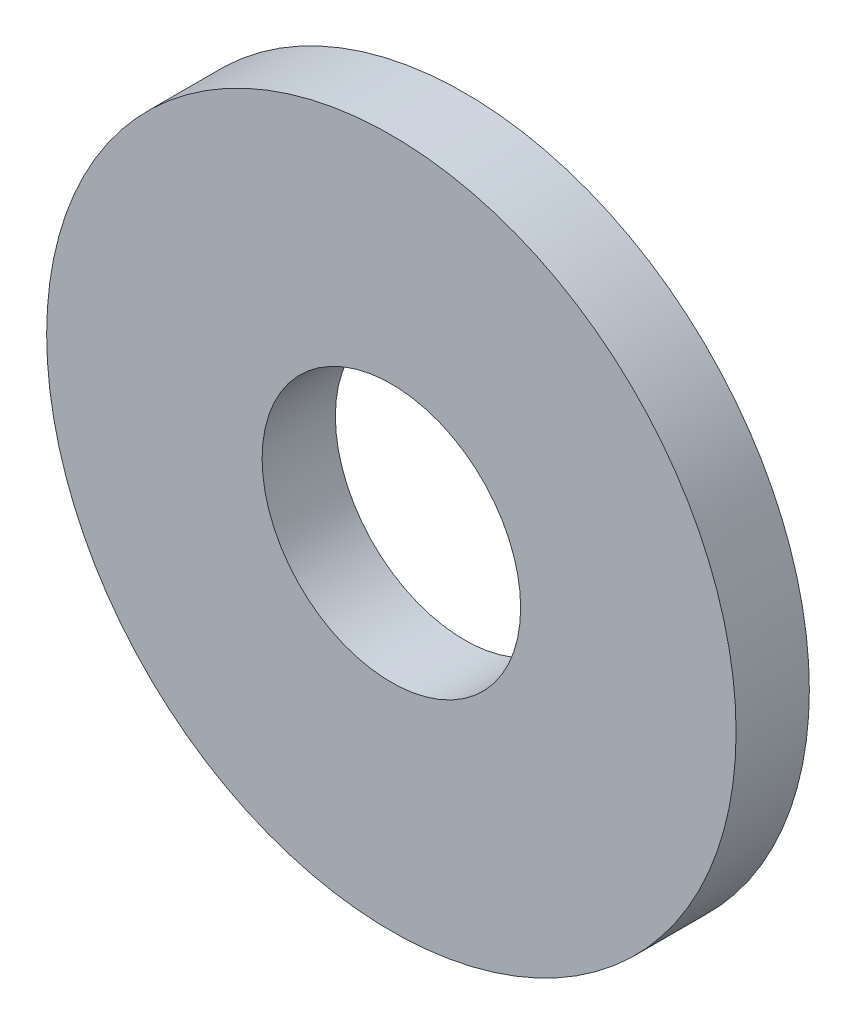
from build123d import *

# Parameters (mm, degrees)
ESQUISSE1_R      = 4
ESQUISSE1_R_2    = 1.5
EXTRUSION1_DEPTH = 0.85


with BuildPart() as part:
    # Esquisse1 → Extrusion1 (new body)
    with BuildSketch(Plane.XY):
        Circle(ESQUISSE1_R)
        Circle(ESQUISSE1_R_2, mode=Mode.SUBTRACT)
    extrude(amount=EXTRUSION1_DEPTH)


solid = part.part
